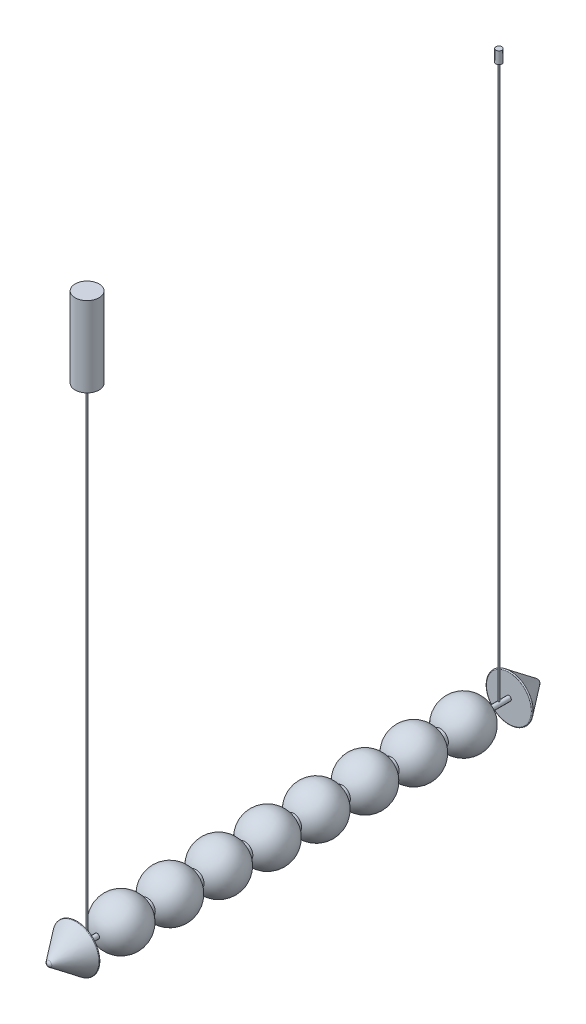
from build123d import *

# Parameters (mm, degrees)
CROQUIS1_R              = 6
SALIENTE_EXTRUIR1_DEPTH = 50
CROQUIS3_W              = 20
CROQUIS3_H              = 10
MATRIZL1_COUNT          = 7
MATRIZL1_PITCH          = 122
CROQUIS5_R              = 6
SALIENTE_EXTRUIR2_DEPTH = 55
CROQUIS7_R              = 1.5
SALIENTE_EXTRUIR3_DEPTH = 1200
REDONDEO1_R             = 2
REDONDEO2_R             = 2
CROQUIS8_R              = 1.5
SALIENTE_EXTRUIR4_DEPTH = 1390
CROQUIS9_R              = 5
SALIENTE_EXTRUIR5_DEPTH = 10
CROQUIS10_R             = 30
SALIENTE_EXTRUIR6_DEPTH = 200
CROQUIS11_R             = 7.5
SALIENTE_EXTRUIR7_DEPTH = 30


with BuildPart() as part:
    # Croquis1 → Saliente-Extruir1 (new body)
    with BuildSketch(Plane.XY):
        Circle(CROQUIS1_R)
    extrude(amount=-SALIENTE_EXTRUIR1_DEPTH)


with BuildPart() as body_2:
    # Croquis2 → Revoluci_n1 (revolve)
    with BuildSketch(Plane(origin=(0, 0, 0), x_dir=(1, 0, 0), z_dir=(0, 1, 0))):
        with BuildLine():
            Line((0, 50), (0, 170))
            ThreePointArc((0, 170), (-60, 110), (0, 50))
        make_face()
    revolve(axis=Axis((0, 0, -50), (0, 0, -1)))


with BuildPart() as body_3:
    # Croquis3 → Revoluci_n2 (revolve)
    with BuildSketch(Plane(origin=(0, 0, 0), x_dir=(1, 0, 0), z_dir=(0, 1, 0)), mode=Mode.PRIVATE) as revoluci_n2_sk:
        with Locations((-10, 171.705810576)):
            Rectangle(CROQUIS3_W, CROQUIS3_H)
    revolve(revoluci_n2_sk.sketch.rotate(Axis((0, 0, -166.705810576), (0, 0, -1)), 180), axis=Axis((0, 0, -166.705810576), (0, 0, -1)))


with BuildPart() as matrizl1_1:
    # MatrizL1: pattern copy
    add(body_2.part.moved(Location(Vector(0, 0, -1) * (1 * MATRIZL1_PITCH))))


with BuildPart() as matrizl1_2:
    # MatrizL1: pattern copy
    add(body_2.part.moved(Location(Vector(0, 0, -1) * (2 * MATRIZL1_PITCH))))


with BuildPart() as matrizl1_3:
    # MatrizL1: pattern copy
    add(body_2.part.moved(Location(Vector(0, 0, -1) * (3 * MATRIZL1_PITCH))))


with BuildPart() as matrizl1_4:
    # MatrizL1: pattern copy
    add(body_2.part.moved(Location(Vector(0, 0, -1) * (4 * MATRIZL1_PITCH))))


with BuildPart() as matrizl1_5:
    # MatrizL1: pattern copy
    add(body_2.part.moved(Location(Vector(0, 0, -1) * (5 * MATRIZL1_PITCH))))


with BuildPart() as matrizl1_6:
    # MatrizL1: pattern copy
    add(body_2.part.moved(Location(Vector(0, 0, -1) * (6 * MATRIZL1_PITCH))))


with BuildPart() as matrizl1_7:
    # MatrizL1: pattern copy
    add(body_3.part.moved(Location(Vector(0, 0, -1) * (1 * MATRIZL1_PITCH))))


with BuildPart() as matrizl1_8:
    # MatrizL1: pattern copy
    add(body_3.part.moved(Location(Vector(0, 0, -1) * (2 * MATRIZL1_PITCH))))


with BuildPart() as matrizl1_9:
    # MatrizL1: pattern copy
    add(body_3.part.moved(Location(Vector(0, 0, -1) * (3 * MATRIZL1_PITCH))))


with BuildPart() as matrizl1_10:
    # MatrizL1: pattern copy
    add(body_3.part.moved(Location(Vector(0, 0, -1) * (4 * MATRIZL1_PITCH))))


with BuildPart() as matrizl1_11:
    # MatrizL1: pattern copy
    add(body_3.part.moved(Location(Vector(0, 0, -1) * (5 * MATRIZL1_PITCH))))


with BuildPart() as matrizl1_12:
    # MatrizL1: pattern copy
    add(body_3.part.moved(Location(Vector(0, 0, -1) * (6 * MATRIZL1_PITCH))))


with BuildPart() as body_16:
    # Croquis4 → Revoluci_n3 (revolve)
    with BuildSketch(Plane(origin=(0, 0, 0), x_dir=(1, 0, 0), z_dir=(0, 1, 0))):
        with BuildLine():
            Line((0, 906.134481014), (0, 1026.134481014))
            ThreePointArc((0, 1026.134481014), (60, 966.134481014), (0, 906.134481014))
        make_face()
    revolve(axis=Axis((0, 0, -906.134481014), (0, 0, -1)))


with BuildPart() as body_17:
    # Croquis5 → Saliente-Extruir2 (new body)
    with BuildSketch(Plane.XY.offset(-1025)):
        Circle(CROQUIS5_R)
    extrude(amount=-SALIENTE_EXTRUIR2_DEPTH)


with BuildPart() as body_18:
    # Croquis6 → Revoluci_n4 (revolve)
    with BuildSketch(Plane(origin=(0, 0, 0), x_dir=(1, 0, 0), z_dir=(0, 1, 0))):
        with BuildLine():
            Line((0, 0), (-60, 0))
            Line((-60, 0), (-7.140967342, -70.47871021))
            ThreePointArc((-7.140967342, -70.47871021), (-3.993674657, -73.204094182), (0, -74.380415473))
            Line((0, -74.380415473), (0, 0))
        make_face()
    revolve(axis=Axis((0, 0, 0), (0, 0, 1)))


with BuildPart() as body_19:
    # Simetr_a1: mirrored copy
    add(body_18.part.mirror(Plane(origin=(0, 0, -540), x_dir=(1, 0, 0), z_dir=(0, 0, -1))))

    # Redondeo2
    redondeo2_edges = [body_19.edges().sort_by_distance(p)[0] for p in [
        (60, 0, -1080),
    ]]
    fillet(redondeo2_edges, radius=REDONDEO2_R)


with BuildPart() as body_20:
    # Croquis7 → Saliente-Extruir3 (new body)
    with BuildSketch(Plane(origin=(0, 0, 0), x_dir=(1, 0, 0), z_dir=(0, 1, 0))):
        with Locations(Location((0, 25, 0), (0, 0, 270))):
            Circle(CROQUIS7_R)
    extrude(amount=SALIENTE_EXTRUIR3_DEPTH)


with BuildPart() as body_18_1:
    add(body_18.part)

    # Redondeo1
    redondeo1_edges = [body_18_1.edges().sort_by_distance(p)[0] for p in [
        (60, 0, 0),
    ]]
    fillet(redondeo1_edges, radius=REDONDEO1_R)


with BuildPart() as body_21:
    # Croquis8 → Saliente-Extruir4 (new body)
    with BuildSketch(Plane(origin=(0, 0, 0), x_dir=(1, 0, 0), z_dir=(0, 1, 0))):
        with Locations(Location((0, 1055, 0), (0, 0, 270))):
            Circle(CROQUIS8_R)
    extrude(amount=SALIENTE_EXTRUIR4_DEPTH)


with BuildPart() as body_22:
    # Croquis9 → Saliente-Extruir5 (new body)
    with BuildSketch(Plane(origin=(0, 1200, 0), x_dir=(1, 0, 0), z_dir=(0, 1, 0))):
        with Locations(Location((0, 25, 0), (0, 0, 270))):
            Circle(CROQUIS9_R)
    extrude(amount=SALIENTE_EXTRUIR5_DEPTH)


with BuildPart() as body_23:
    # Croquis10 → Saliente-Extruir6 (new body)
    with BuildSketch(Plane(origin=(0, 1210, 0), x_dir=(1, 0, 0), z_dir=(0, 1, 0))):
        with Locations(Location((0, 25, 0), (0, 0, 270))):
            Circle(CROQUIS10_R)
    extrude(amount=SALIENTE_EXTRUIR6_DEPTH)


with BuildPart() as body_24:
    # Croquis11 → Saliente-Extruir7 (new body)
    with BuildSketch(Plane(origin=(0, 1390, 0), x_dir=(1, 0, 0), z_dir=(0, 1, 0))):
        with Locations(Location((0, 1055, 0), (0, 0, 270))):
            Circle(CROQUIS11_R)
    extrude(amount=SALIENTE_EXTRUIR7_DEPTH)


solid = Compound([part.part, body_2.part, body_3.part, matrizl1_1.part, matrizl1_2.part, matrizl1_3.part, matrizl1_4.part, matrizl1_5.part, matrizl1_6.part, matrizl1_7.part, matrizl1_8.part, matrizl1_9.part, matrizl1_10.part, matrizl1_11.part, matrizl1_12.part, body_16.part, body_17.part, body_19.part, body_20.part, body_18_1.part, body_21.part, body_22.part, body_23.part, body_24.part])
